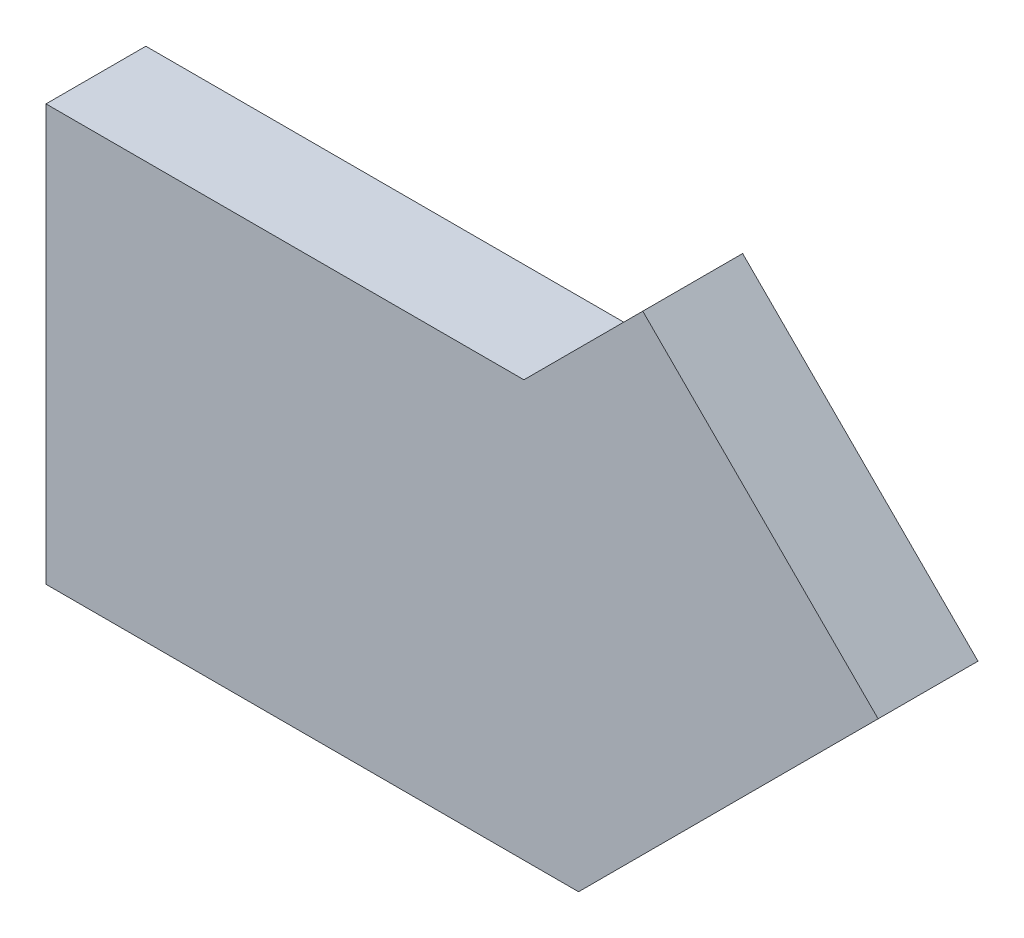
from build123d import *

# Parameters (mm, degrees)
BOSS_EXTRUDE1_DEPTH = 6


with BuildPart() as part:
    # Sketch1 → Boss-Extrude1 (new body)
    with BuildSketch(Plane.XY):
        Polygon((0, 0), (32, 0), (50, 18), (35.857864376, 32.142135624), (28.715728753, 25), (0, 25), align=None)
    extrude(amount=BOSS_EXTRUDE1_DEPTH)


solid = part.part
